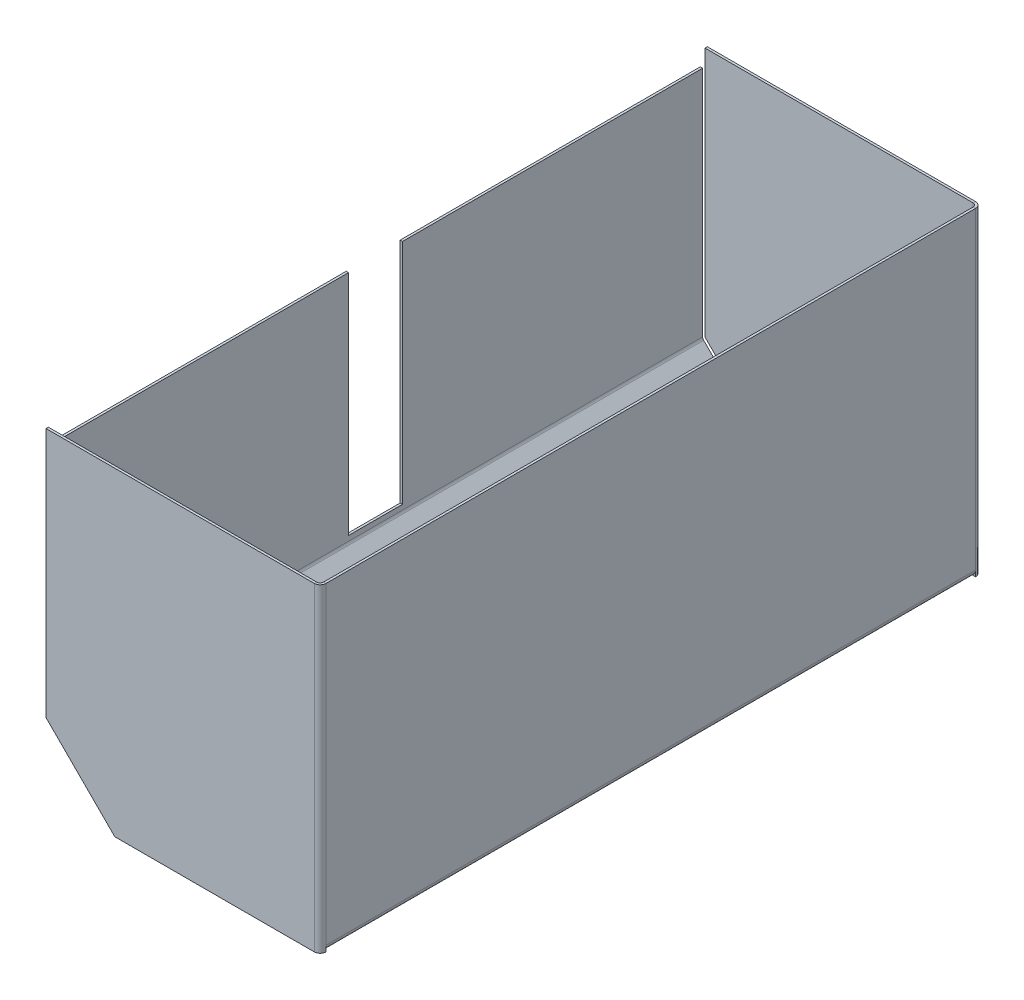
ISO-10303-21;
HEADER;
FILE_DESCRIPTION(('STEP AP214'),'2;1');
FILE_NAME('part.step','',(''),(''),'','','');
FILE_SCHEMA(('AUTOMOTIVE_DESIGN { 1 0 10303 214 1 1 1 1 }'));
ENDSEC;
DATA;
#1=APPLICATION_CONTEXT('core data for automotive mechanical design processes');
#2=APPLICATION_PROTOCOL_DEFINITION('international standard','automotive_design',2000,#1);
#3=PRODUCT_CONTEXT('',#1,'mechanical');
#4=PRODUCT('Part','Part','',(#3));
#5=PRODUCT_RELATED_PRODUCT_CATEGORY('part','',(#4));
#6=PRODUCT_DEFINITION_FORMATION('','',#4);
#7=PRODUCT_DEFINITION_CONTEXT('part definition',#1,'design');
#8=PRODUCT_DEFINITION('design','',#6,#7);
#9=PRODUCT_DEFINITION_SHAPE('','',#8);
#10=(LENGTH_UNIT() NAMED_UNIT(*) SI_UNIT(.MILLI.,.METRE.));
#11=(NAMED_UNIT(*) PLANE_ANGLE_UNIT() SI_UNIT($,.RADIAN.));
#12=(NAMED_UNIT(*) SI_UNIT($,.STERADIAN.) SOLID_ANGLE_UNIT());
#13=UNCERTAINTY_MEASURE_WITH_UNIT(LENGTH_MEASURE(1.E-05),#10,'distance_accuracy_value','');
#14=(GEOMETRIC_REPRESENTATION_CONTEXT(3) GLOBAL_UNCERTAINTY_ASSIGNED_CONTEXT((#13)) GLOBAL_UNIT_ASSIGNED_CONTEXT((#10,
#11,#12)) REPRESENTATION_CONTEXT('',''));
#15=CARTESIAN_POINT('',(0.,0.,0.));
#16=DIRECTION('',(0.,0.,1.));
#17=DIRECTION('',(1.,0.,0.));
#18=AXIS2_PLACEMENT_3D('',#15,#16,#17);
#19=CARTESIAN_POINT('',(164.59644118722,-348.502989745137,5.00000000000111));
#20=DIRECTION('',(0.,0.,-1.));
#21=DIRECTION('',(-1.,0.,0.));
#22=AXIS2_PLACEMENT_3D('',#19,#20,#21);
#23=PLANE('',#22);
#24=DIRECTION('',(-1.,0.,0.));
#25=VECTOR('',#24,1.);
#26=CARTESIAN_POINT('',(161.59644118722,-348.502989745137,5.00000000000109));
#27=LINE('',#26,#25);
#28=CARTESIAN_POINT('',(161.59644118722,-348.502989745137,5.00000000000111));
#29=VERTEX_POINT('',#28);
#30=CARTESIAN_POINT('',(159.59644118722,-348.502989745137,5.00000000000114));
#31=VERTEX_POINT('',#30);
#32=EDGE_CURVE('E1102',#29,#31,#27,.T.);
#33=ORIENTED_EDGE('',*,*,#32,.F.);
#34=CARTESIAN_POINT('',(164.59644118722,-348.502989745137,5.00000000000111));
#35=DIRECTION('',(0.,0.,1.));
#36=DIRECTION('',(1.,0.,0.));
#37=AXIS2_PLACEMENT_3D('',#34,#35,#36);
#38=CIRCLE('',#37,2.9999999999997);
#39=CARTESIAN_POINT('',(162.47512084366,-350.624310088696,5.00000000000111));
#40=VERTEX_POINT('',#39);
#41=EDGE_CURVE('E242',#40,#29,#38,.F.);
#42=ORIENTED_EDGE('',*,*,#41,.F.);
#43=DIRECTION('',(-0.707106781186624,-0.707106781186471,0.));
#44=VECTOR('',#43,1.);
#45=CARTESIAN_POINT('',(162.47512084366,-350.624310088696,5.00000000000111));
#46=LINE('',#45,#44);
#47=CARTESIAN_POINT('',(161.060907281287,-352.03852365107,5.00000000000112));
#48=VERTEX_POINT('',#47);
#49=EDGE_CURVE('E11',#40,#48,#46,.T.);
#50=ORIENTED_EDGE('',*,*,#49,.T.);
#51=CARTESIAN_POINT('',(164.59644118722,-348.502989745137,5.00000000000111));
#52=DIRECTION('',(0.,0.,1.));
#53=DIRECTION('',(1.,0.,0.));
#54=AXIS2_PLACEMENT_3D('',#51,#52,#53);
#55=CIRCLE('',#54,4.9999999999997);
#56=EDGE_CURVE('E519',#48,#31,#55,.F.);
#57=ORIENTED_EDGE('',*,*,#56,.T.);
#58=EDGE_LOOP('',(#33,#42,#50,#57));
#59=FACE_BOUND('',#58,.T.);
#60=ADVANCED_FACE('F26',(#59),#23,.T.);
#61=CARTESIAN_POINT('',(164.596441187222,-348.502989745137,559.990989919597));
#62=DIRECTION('',(0.,0.,-1.));
#63=DIRECTION('',(-1.,0.,0.));
#64=AXIS2_PLACEMENT_3D('',#61,#62,#63);
#65=PLANE('',#64);
#66=CARTESIAN_POINT('',(164.596441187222,-348.502989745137,559.990989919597));
#67=DIRECTION('',(0.,0.,1.));
#68=DIRECTION('',(1.,0.,0.));
#69=AXIS2_PLACEMENT_3D('',#66,#67,#68);
#70=CIRCLE('',#69,2.9999999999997);
#71=CARTESIAN_POINT('',(161.596441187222,-348.502989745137,559.990989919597));
#72=VERTEX_POINT('',#71);
#73=CARTESIAN_POINT('',(162.475120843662,-350.624310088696,559.990989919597));
#74=VERTEX_POINT('',#73);
#75=EDGE_CURVE('E248',#72,#74,#70,.T.);
#76=ORIENTED_EDGE('',*,*,#75,.F.);
#77=DIRECTION('',(-1.,0.,0.));
#78=VECTOR('',#77,1.);
#79=CARTESIAN_POINT('',(161.596441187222,-348.502989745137,559.990989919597));
#80=LINE('',#79,#78);
#81=CARTESIAN_POINT('',(159.596441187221,-348.502989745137,559.990989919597));
#82=VERTEX_POINT('',#81);
#83=EDGE_CURVE('E246',#72,#82,#80,.T.);
#84=ORIENTED_EDGE('',*,*,#83,.T.);
#85=CARTESIAN_POINT('',(164.596441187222,-348.502989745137,559.990989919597));
#86=DIRECTION('',(0.,0.,1.));
#87=DIRECTION('',(1.,0.,0.));
#88=AXIS2_PLACEMENT_3D('',#85,#86,#87);
#89=CIRCLE('',#88,4.9999999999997);
#90=CARTESIAN_POINT('',(161.060907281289,-352.038523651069,559.990989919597));
#91=VERTEX_POINT('',#90);
#92=EDGE_CURVE('E237',#82,#91,#89,.T.);
#93=ORIENTED_EDGE('',*,*,#92,.T.);
#94=DIRECTION('',(-0.707106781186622,-0.707106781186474,0.));
#95=VECTOR('',#94,1.);
#96=CARTESIAN_POINT('',(162.475120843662,-350.624310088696,559.990989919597));
#97=LINE('',#96,#95);
#98=EDGE_CURVE('E30',#74,#91,#97,.T.);
#99=ORIENTED_EDGE('',*,*,#98,.F.);
#100=EDGE_LOOP('',(#76,#84,#93,#99));
#101=FACE_BOUND('',#100,.T.);
#102=ADVANCED_FACE('F28',(#101),#65,.F.);
#103=CARTESIAN_POINT('',(164.596441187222,-348.502989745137,559.990989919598));
#104=DIRECTION('',(0.,0.,1.));
#105=DIRECTION('',(-1.,0.,0.));
#106=AXIS2_PLACEMENT_3D('',#103,#104,#105);
#107=CYLINDRICAL_SURFACE('',#106,4.9999999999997);
#108=DIRECTION('',(0.,0.,1.));
#109=VECTOR('',#108,1.);
#110=CARTESIAN_POINT('',(161.060907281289,-352.038523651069,559.990989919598));
#111=LINE('',#110,#109);
#112=EDGE_CURVE('E41',#91,#48,#111,.F.);
#113=ORIENTED_EDGE('',*,*,#112,.F.);
#114=ORIENTED_EDGE('',*,*,#92,.F.);
#115=DIRECTION('',(0.,0.,-1.));
#116=VECTOR('',#115,1.);
#117=CARTESIAN_POINT('',(159.59644118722,-348.502989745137,5.00000000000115));
#118=LINE('',#117,#116);
#119=EDGE_CURVE('E46',#82,#31,#118,.T.);
#120=ORIENTED_EDGE('',*,*,#119,.T.);
#121=ORIENTED_EDGE('',*,*,#56,.F.);
#122=EDGE_LOOP('',(#113,#114,#120,#121));
#123=FACE_BOUND('',#122,.T.);
#124=ADVANCED_FACE('F239',(#123),#107,.T.);
#125=CARTESIAN_POINT('',(164.596441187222,-348.502989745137,559.990989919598));
#126=DIRECTION('',(0.,0.,1.));
#127=DIRECTION('',(-1.,0.,0.));
#128=AXIS2_PLACEMENT_3D('',#125,#126,#127);
#129=CYLINDRICAL_SURFACE('',#128,2.9999999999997);
#130=DIRECTION('',(0.,0.,1.));
#131=VECTOR('',#130,1.);
#132=CARTESIAN_POINT('',(162.475120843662,-350.624310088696,559.990989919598));
#133=LINE('',#132,#131);
#134=EDGE_CURVE('E515',#74,#40,#133,.F.);
#135=ORIENTED_EDGE('',*,*,#134,.T.);
#136=ORIENTED_EDGE('',*,*,#41,.T.);
#137=DIRECTION('',(0.,0.,1.));
#138=VECTOR('',#137,1.);
#139=CARTESIAN_POINT('',(161.59644118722,-348.502989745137,5.00000000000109));
#140=LINE('',#139,#138);
#141=EDGE_CURVE('E253',#29,#72,#140,.T.);
#142=ORIENTED_EDGE('',*,*,#141,.T.);
#143=ORIENTED_EDGE('',*,*,#75,.T.);
#144=EDGE_LOOP('',(#135,#136,#142,#143));
#145=FACE_BOUND('',#144,.T.);
#146=ADVANCED_FACE('F593',(#145),#129,.F.);
#147=CARTESIAN_POINT('',(217.956044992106,-408.933661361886,559.990989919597));
#148=DIRECTION('',(0.,0.,1.));
#149=DIRECTION('',(1.,0.,0.));
#150=AXIS2_PLACEMENT_3D('',#147,#148,#149);
#151=PLANE('',#150);
#152=DIRECTION('',(0.707106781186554,-0.707106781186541,0.));
#153=VECTOR('',#152,1.);
#154=CARTESIAN_POINT('',(219.370258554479,-407.519447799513,559.990989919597));
#155=LINE('',#154,#153);
#156=CARTESIAN_POINT('',(218.49157889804,-406.640768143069,559.990989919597));
#157=VERTEX_POINT('',#156);
#158=EDGE_CURVE('E300',#74,#157,#155,.T.);
#159=ORIENTED_EDGE('',*,*,#158,.F.);
#160=ORIENTED_EDGE('',*,*,#98,.T.);
#161=DIRECTION('',(0.707106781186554,-0.707106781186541,0.));
#162=VECTOR('',#161,1.);
#163=CARTESIAN_POINT('',(217.956044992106,-408.933661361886,559.990989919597));
#164=LINE('',#163,#162);
#165=CARTESIAN_POINT('',(217.077365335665,-408.054981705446,559.990989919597));
#166=VERTEX_POINT('',#165);
#167=EDGE_CURVE('E305',#91,#166,#164,.T.);
#168=ORIENTED_EDGE('',*,*,#167,.T.);
#169=DIRECTION('',(-0.707106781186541,-0.707106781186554,0.));
#170=VECTOR('',#169,1.);
#171=CARTESIAN_POINT('',(218.491578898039,-406.640768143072,559.990989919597));
#172=LINE('',#171,#170);
#173=EDGE_CURVE('E290',#157,#166,#172,.T.);
#174=ORIENTED_EDGE('',*,*,#173,.F.);
#175=EDGE_LOOP('',(#159,#160,#168,#174));
#176=FACE_BOUND('',#175,.T.);
#177=ADVANCED_FACE('F525',(#176),#151,.T.);
#178=CARTESIAN_POINT('',(217.956044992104,-408.933661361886,5.00000000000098));
#179=DIRECTION('',(0.707106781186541,0.707106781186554,0.));
#180=DIRECTION('',(-0.707106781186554,0.707106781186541,0.));
#181=AXIS2_PLACEMENT_3D('',#178,#179,#180);
#182=PLANE('',#181);
#183=ORIENTED_EDGE('',*,*,#112,.T.);
#184=DIRECTION('',(-0.707106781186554,0.707106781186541,0.));
#185=VECTOR('',#184,1.);
#186=CARTESIAN_POINT('',(160.182227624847,-351.15984399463,5.00000000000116));
#187=LINE('',#186,#185);
#188=CARTESIAN_POINT('',(217.077365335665,-408.054981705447,5.00000000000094));
#189=VERTEX_POINT('',#188);
#190=EDGE_CURVE('E302',#189,#48,#187,.T.);
#191=ORIENTED_EDGE('',*,*,#190,.F.);
#192=DIRECTION('',(0.,0.,-1.));
#193=VECTOR('',#192,1.);
#194=CARTESIAN_POINT('',(217.077365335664,-408.054981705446,5.00000000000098));
#195=LINE('',#194,#193);
#196=EDGE_CURVE('E293',#166,#189,#195,.T.);
#197=ORIENTED_EDGE('',*,*,#196,.F.);
#198=ORIENTED_EDGE('',*,*,#167,.F.);
#199=EDGE_LOOP('',(#183,#191,#197,#198));
#200=FACE_BOUND('',#199,.T.);
#201=ADVANCED_FACE('F530',(#200),#182,.F.);
#202=CARTESIAN_POINT('',(219.370258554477,-407.519447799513,5.00000000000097));
#203=DIRECTION('',(0.707106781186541,0.707106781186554,0.));
#204=DIRECTION('',(-0.707106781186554,0.707106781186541,0.));
#205=AXIS2_PLACEMENT_3D('',#202,#203,#204);
#206=PLANE('',#205);
#207=DIRECTION('',(-0.707106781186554,0.707106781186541,0.));
#208=VECTOR('',#207,1.);
#209=CARTESIAN_POINT('',(161.59644118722,-349.745630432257,5.00000000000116));
#210=LINE('',#209,#208);
#211=CARTESIAN_POINT('',(218.491578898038,-406.640768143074,5.00000000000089));
#212=VERTEX_POINT('',#211);
#213=EDGE_CURVE('E297',#212,#40,#210,.T.);
#214=ORIENTED_EDGE('',*,*,#213,.T.);
#215=ORIENTED_EDGE('',*,*,#134,.F.);
#216=ORIENTED_EDGE('',*,*,#158,.T.);
#217=DIRECTION('',(0.,0.,1.));
#218=VECTOR('',#217,1.);
#219=CARTESIAN_POINT('',(218.491578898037,-406.640768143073,5.00000000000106));
#220=LINE('',#219,#218);
#221=EDGE_CURVE('E287',#212,#157,#220,.T.);
#222=ORIENTED_EDGE('',*,*,#221,.F.);
#223=EDGE_LOOP('',(#214,#215,#216,#222));
#224=FACE_BOUND('',#223,.T.);
#225=ADVANCED_FACE('F545',(#224),#206,.T.);
#226=CARTESIAN_POINT('',(220.612899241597,-404.519447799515,5.00000000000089));
#227=DIRECTION('',(0.,0.,-1.));
#228=DIRECTION('',(0.,1.,0.));
#229=AXIS2_PLACEMENT_3D('',#226,#227,#228);
#230=PLANE('',#229);
#231=DIRECTION('',(-0.707106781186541,-0.707106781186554,0.));
#232=VECTOR('',#231,1.);
#233=CARTESIAN_POINT('',(218.491578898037,-406.640768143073,5.00000000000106));
#234=LINE('',#233,#232);
#235=EDGE_CURVE('E279',#212,#189,#234,.T.);
#236=ORIENTED_EDGE('',*,*,#235,.F.);
#237=CARTESIAN_POINT('',(220.612899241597,-404.519447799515,5.00000000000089));
#238=DIRECTION('',(0.,0.,1.));
#239=DIRECTION('',(0.,-1.,0.));
#240=AXIS2_PLACEMENT_3D('',#237,#238,#239);
#241=CIRCLE('',#240,2.99999999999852);
#242=CARTESIAN_POINT('',(220.612899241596,-407.519447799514,5.00000000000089));
#243=VERTEX_POINT('',#242);
#244=EDGE_CURVE('E490',#243,#212,#241,.F.);
#245=ORIENTED_EDGE('',*,*,#244,.F.);
#246=DIRECTION('',(0.,-1.,0.));
#247=VECTOR('',#246,1.);
#248=CARTESIAN_POINT('',(220.612899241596,-407.519447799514,5.00000000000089));
#249=LINE('',#248,#247);
#250=CARTESIAN_POINT('',(220.612899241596,-409.519447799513,5.00000000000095));
#251=VERTEX_POINT('',#250);
#252=EDGE_CURVE('E508',#243,#251,#249,.T.);
#253=ORIENTED_EDGE('',*,*,#252,.T.);
#254=CARTESIAN_POINT('',(220.612899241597,-404.519447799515,5.00000000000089));
#255=DIRECTION('',(0.,0.,1.));
#256=DIRECTION('',(0.,-1.,0.));
#257=AXIS2_PLACEMENT_3D('',#254,#255,#256);
#258=CIRCLE('',#257,4.99999999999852);
#259=EDGE_CURVE('E502',#251,#189,#258,.F.);
#260=ORIENTED_EDGE('',*,*,#259,.T.);
#261=EDGE_LOOP('',(#236,#245,#253,#260));
#262=FACE_BOUND('',#261,.T.);
#263=ADVANCED_FACE('F535',(#262),#230,.T.);
#264=CARTESIAN_POINT('',(220.612899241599,-404.51944779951,559.990989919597));
#265=DIRECTION('',(0.,0.,-1.));
#266=DIRECTION('',(0.,1.,0.));
#267=AXIS2_PLACEMENT_3D('',#264,#265,#266);
#268=PLANE('',#267);
#269=CARTESIAN_POINT('',(220.612899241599,-404.51944779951,559.990989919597));
#270=DIRECTION('',(0.,0.,1.));
#271=DIRECTION('',(0.,-1.,0.));
#272=AXIS2_PLACEMENT_3D('',#269,#270,#271);
#273=CIRCLE('',#272,2.99999999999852);
#274=CARTESIAN_POINT('',(220.612899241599,-407.519447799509,559.990989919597));
#275=VERTEX_POINT('',#274);
#276=EDGE_CURVE('E496',#157,#275,#273,.T.);
#277=ORIENTED_EDGE('',*,*,#276,.F.);
#278=ORIENTED_EDGE('',*,*,#173,.T.);
#279=CARTESIAN_POINT('',(220.612899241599,-404.51944779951,559.990989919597));
#280=DIRECTION('',(0.,0.,1.));
#281=DIRECTION('',(0.,-1.,0.));
#282=AXIS2_PLACEMENT_3D('',#279,#280,#281);
#283=CIRCLE('',#282,4.99999999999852);
#284=CARTESIAN_POINT('',(220.612899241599,-409.519447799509,559.990989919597));
#285=VERTEX_POINT('',#284);
#286=EDGE_CURVE('E493',#166,#285,#283,.T.);
#287=ORIENTED_EDGE('',*,*,#286,.T.);
#288=DIRECTION('',(0.,-1.,0.));
#289=VECTOR('',#288,1.);
#290=CARTESIAN_POINT('',(220.612899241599,-407.519447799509,559.990989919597));
#291=LINE('',#290,#289);
#292=EDGE_CURVE('E505',#275,#285,#291,.T.);
#293=ORIENTED_EDGE('',*,*,#292,.F.);
#294=EDGE_LOOP('',(#277,#278,#287,#293));
#295=FACE_BOUND('',#294,.T.);
#296=ADVANCED_FACE('F551',(#295),#268,.F.);
#297=CARTESIAN_POINT('',(220.612899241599,-404.51944779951,559.990989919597));
#298=DIRECTION('',(0.,0.,1.));
#299=DIRECTION('',(-0.707106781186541,-0.707106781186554,0.));
#300=AXIS2_PLACEMENT_3D('',#297,#298,#299);
#301=CYLINDRICAL_SURFACE('',#300,4.99999999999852);
#302=DIRECTION('',(0.,0.,1.));
#303=VECTOR('',#302,1.);
#304=CARTESIAN_POINT('',(220.612899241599,-409.519447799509,559.990989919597));
#305=LINE('',#304,#303);
#306=EDGE_CURVE('E499',#285,#251,#305,.F.);
#307=ORIENTED_EDGE('',*,*,#306,.F.);
#308=ORIENTED_EDGE('',*,*,#286,.F.);
#309=ORIENTED_EDGE('',*,*,#196,.T.);
#310=ORIENTED_EDGE('',*,*,#259,.F.);
#311=EDGE_LOOP('',(#307,#308,#309,#310));
#312=FACE_BOUND('',#311,.T.);
#313=ADVANCED_FACE('F533',(#312),#301,.T.);
#314=CARTESIAN_POINT('',(220.612899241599,-404.51944779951,559.990989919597));
#315=DIRECTION('',(0.,0.,1.));
#316=DIRECTION('',(-0.707106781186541,-0.707106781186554,0.));
#317=AXIS2_PLACEMENT_3D('',#314,#315,#316);
#318=CYLINDRICAL_SURFACE('',#317,2.99999999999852);
#319=DIRECTION('',(0.,0.,1.));
#320=VECTOR('',#319,1.);
#321=CARTESIAN_POINT('',(220.612899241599,-407.519447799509,559.990989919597));
#322=LINE('',#321,#320);
#323=EDGE_CURVE('E494',#275,#243,#322,.F.);
#324=ORIENTED_EDGE('',*,*,#323,.T.);
#325=ORIENTED_EDGE('',*,*,#244,.T.);
#326=ORIENTED_EDGE('',*,*,#221,.T.);
#327=ORIENTED_EDGE('',*,*,#276,.T.);
#328=EDGE_LOOP('',(#324,#325,#326,#327));
#329=FACE_BOUND('',#328,.T.);
#330=ADVANCED_FACE('F548',(#329),#318,.F.);
#331=CARTESIAN_POINT('',(392.78961265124,-409.519447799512,559.990989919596));
#332=DIRECTION('',(0.,0.,1.));
#333=DIRECTION('',(1.,0.,0.));
#334=AXIS2_PLACEMENT_3D('',#331,#332,#333);
#335=PLANE('',#334);
#336=DIRECTION('',(-1.,0.,0.));
#337=VECTOR('',#336,1.);
#338=CARTESIAN_POINT('',(392.78961265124,-407.519447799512,559.990989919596));
#339=LINE('',#338,#337);
#340=CARTESIAN_POINT('',(389.789612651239,-407.519447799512,559.990989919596));
#341=VERTEX_POINT('',#340);
#342=EDGE_CURVE('E314',#275,#341,#339,.F.);
#343=ORIENTED_EDGE('',*,*,#342,.F.);
#344=ORIENTED_EDGE('',*,*,#292,.T.);
#345=DIRECTION('',(1.,0.,0.));
#346=VECTOR('',#345,1.);
#347=CARTESIAN_POINT('',(392.78961265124,-409.519447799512,559.990989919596));
#348=LINE('',#347,#346);
#349=CARTESIAN_POINT('',(389.78961265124,-409.519447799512,559.990989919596));
#350=VERTEX_POINT('',#349);
#351=EDGE_CURVE('E308',#285,#350,#348,.T.);
#352=ORIENTED_EDGE('',*,*,#351,.T.);
#353=DIRECTION('',(0.,-1.,0.));
#354=VECTOR('',#353,1.);
#355=CARTESIAN_POINT('',(389.78961265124,-407.519447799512,559.990989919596));
#356=LINE('',#355,#354);
#357=EDGE_CURVE('E322',#341,#350,#356,.T.);
#358=ORIENTED_EDGE('',*,*,#357,.F.);
#359=EDGE_LOOP('',(#343,#344,#352,#358));
#360=FACE_BOUND('',#359,.T.);
#361=ADVANCED_FACE('F555',(#360),#335,.T.);
#362=CARTESIAN_POINT('',(392.78961265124,-409.519447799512,559.990989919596));
#363=DIRECTION('',(0.,-1.,0.));
#364=DIRECTION('',(1.,0.,0.));
#365=AXIS2_PLACEMENT_3D('',#362,#363,#364);
#366=PLANE('',#365);
#367=ORIENTED_EDGE('',*,*,#351,.F.);
#368=ORIENTED_EDGE('',*,*,#306,.T.);
#369=DIRECTION('',(-1.,0.,0.));
#370=VECTOR('',#369,1.);
#371=CARTESIAN_POINT('',(219.370258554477,-409.519447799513,5.00000000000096));
#372=LINE('',#371,#370);
#373=CARTESIAN_POINT('',(389.789612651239,-409.519447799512,5.));
#374=VERTEX_POINT('',#373);
#375=EDGE_CURVE('E311',#374,#251,#372,.T.);
#376=ORIENTED_EDGE('',*,*,#375,.F.);
#377=DIRECTION('',(0.,0.,1.));
#378=VECTOR('',#377,1.);
#379=CARTESIAN_POINT('',(389.78961265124,-409.519447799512,559.990989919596));
#380=LINE('',#379,#378);
#381=EDGE_CURVE('E319',#374,#350,#380,.T.);
#382=ORIENTED_EDGE('',*,*,#381,.T.);
#383=EDGE_LOOP('',(#367,#368,#376,#382));
#384=FACE_BOUND('',#383,.T.);
#385=ADVANCED_FACE('F559',(#384),#366,.T.);
#386=CARTESIAN_POINT('',(392.78961265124,-407.519447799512,559.990989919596));
#387=DIRECTION('',(0.,-1.,0.));
#388=DIRECTION('',(1.,0.,0.));
#389=AXIS2_PLACEMENT_3D('',#386,#387,#388);
#390=PLANE('',#389);
#391=ORIENTED_EDGE('',*,*,#323,.F.);
#392=ORIENTED_EDGE('',*,*,#342,.T.);
#393=DIRECTION('',(0.,0.,-1.));
#394=VECTOR('',#393,1.);
#395=CARTESIAN_POINT('',(389.789612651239,-407.519447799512,5.00000000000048));
#396=LINE('',#395,#394);
#397=CARTESIAN_POINT('',(389.789612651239,-407.519447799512,5.));
#398=VERTEX_POINT('',#397);
#399=EDGE_CURVE('E325',#398,#341,#396,.F.);
#400=ORIENTED_EDGE('',*,*,#399,.F.);
#401=DIRECTION('',(1.,0.,0.));
#402=VECTOR('',#401,1.);
#403=CARTESIAN_POINT('',(392.789612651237,-407.519447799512,5.));
#404=LINE('',#403,#402);
#405=EDGE_CURVE('E316',#398,#243,#404,.F.);
#406=ORIENTED_EDGE('',*,*,#405,.T.);
#407=EDGE_LOOP('',(#391,#392,#400,#406));
#408=FACE_BOUND('',#407,.T.);
#409=ADVANCED_FACE('F577',(#408),#390,.F.);
#410=CARTESIAN_POINT('',(389.789612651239,-404.519447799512,559.990989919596));
#411=DIRECTION('',(0.,0.,-1.));
#412=DIRECTION('',(-1.,0.,0.));
#413=AXIS2_PLACEMENT_3D('',#410,#411,#412);
#414=PLANE('',#413);
#415=CARTESIAN_POINT('',(389.789612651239,-404.519447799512,559.990989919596));
#416=DIRECTION('',(0.,0.,1.));
#417=DIRECTION('',(1.,0.,0.));
#418=AXIS2_PLACEMENT_3D('',#415,#416,#417);
#419=CIRCLE('',#418,5.00000000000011);
#420=CARTESIAN_POINT('',(392.78961265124,-408.519447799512,559.990989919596));
#421=VERTEX_POINT('',#420);
#422=EDGE_CURVE('E484',#350,#421,#419,.T.);
#423=ORIENTED_EDGE('',*,*,#422,.T.);
#424=DIRECTION('',(-1.66533453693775E-13,1.,0.));
#425=VECTOR('',#424,1.);
#426=CARTESIAN_POINT('',(392.78961265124,-409.519447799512,559.990989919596));
#427=LINE('',#426,#425);
#428=CARTESIAN_POINT('',(392.78961265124,-404.519447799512,559.990989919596));
#429=VERTEX_POINT('',#428);
#430=EDGE_CURVE('E333',#421,#429,#427,.T.);
#431=ORIENTED_EDGE('',*,*,#430,.T.);
#432=CARTESIAN_POINT('',(389.789612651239,-404.519447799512,559.990989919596));
#433=DIRECTION('',(0.,0.,1.));
#434=DIRECTION('',(1.,0.,0.));
#435=AXIS2_PLACEMENT_3D('',#432,#433,#434);
#436=CIRCLE('',#435,3.00000000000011);
#437=EDGE_CURVE('E468',#341,#429,#436,.T.);
#438=ORIENTED_EDGE('',*,*,#437,.F.);
#439=ORIENTED_EDGE('',*,*,#357,.T.);
#440=EDGE_LOOP('',(#423,#431,#438,#439));
#441=FACE_BOUND('',#440,.T.);
#442=ADVANCED_FACE('F579',(#441),#414,.F.);
#443=CARTESIAN_POINT('',(389.789612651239,-404.519447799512,5.));
#444=DIRECTION('',(0.,0.,-1.));
#445=DIRECTION('',(-1.,0.,0.));
#446=AXIS2_PLACEMENT_3D('',#443,#444,#445);
#447=PLANE('',#446);
#448=DIRECTION('',(0.,1.,0.));
#449=VECTOR('',#448,1.);
#450=CARTESIAN_POINT('',(392.789612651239,-409.519447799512,5.));
#451=LINE('',#450,#449);
#452=CARTESIAN_POINT('',(392.789612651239,-408.519447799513,5.));
#453=VERTEX_POINT('',#452);
#454=CARTESIAN_POINT('',(392.789612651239,-404.519447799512,5.));
#455=VERTEX_POINT('',#454);
#456=EDGE_CURVE('E395',#453,#455,#451,.T.);
#457=ORIENTED_EDGE('',*,*,#456,.F.);
#458=CARTESIAN_POINT('',(389.789612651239,-404.519447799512,5.));
#459=DIRECTION('',(0.,0.,1.));
#460=DIRECTION('',(1.,0.,0.));
#461=AXIS2_PLACEMENT_3D('',#458,#459,#460);
#462=CIRCLE('',#461,5.00000000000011);
#463=EDGE_CURVE('E483',#453,#374,#462,.F.);
#464=ORIENTED_EDGE('',*,*,#463,.T.);
#465=DIRECTION('',(0.,-1.,0.));
#466=VECTOR('',#465,1.);
#467=CARTESIAN_POINT('',(389.789612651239,-409.519447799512,5.00000000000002));
#468=LINE('',#467,#466);
#469=EDGE_CURVE('E307',#398,#374,#468,.T.);
#470=ORIENTED_EDGE('',*,*,#469,.F.);
#471=CARTESIAN_POINT('',(389.789612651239,-404.519447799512,5.));
#472=DIRECTION('',(0.,0.,1.));
#473=DIRECTION('',(1.,0.,0.));
#474=AXIS2_PLACEMENT_3D('',#471,#472,#473);
#475=CIRCLE('',#474,3.00000000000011);
#476=EDGE_CURVE('E471',#455,#398,#475,.F.);
#477=ORIENTED_EDGE('',*,*,#476,.F.);
#478=EDGE_LOOP('',(#457,#464,#470,#477));
#479=FACE_BOUND('',#478,.T.);
#480=ADVANCED_FACE('F569',(#479),#447,.T.);
#481=CARTESIAN_POINT('',(389.789612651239,-404.519447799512,559.990989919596));
#482=DIRECTION('',(0.,0.,1.));
#483=DIRECTION('',(0.,-1.,0.));
#484=AXIS2_PLACEMENT_3D('',#481,#482,#483);
#485=CYLINDRICAL_SURFACE('',#484,5.00000000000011);
#486=DIRECTION('',(0.,0.,1.));
#487=VECTOR('',#486,1.);
#488=CARTESIAN_POINT('',(394.78961265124,-404.519447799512,559.990989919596));
#489=LINE('',#488,#487);
#490=CARTESIAN_POINT('',(394.78961265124,-404.519447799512,559.990989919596));
#491=VERTEX_POINT('',#490);
#492=CARTESIAN_POINT('',(394.78961265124,-404.519447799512,5.));
#493=VERTEX_POINT('',#492);
#494=EDGE_CURVE('E480',#491,#493,#489,.F.);
#495=ORIENTED_EDGE('',*,*,#494,.F.);
#496=EDGE_CURVE('E474',#421,#491,#419,.T.);
#497=ORIENTED_EDGE('',*,*,#496,.F.);
#498=ORIENTED_EDGE('',*,*,#422,.F.);
#499=ORIENTED_EDGE('',*,*,#381,.F.);
#500=ORIENTED_EDGE('',*,*,#463,.F.);
#501=EDGE_CURVE('E485',#493,#453,#462,.F.);
#502=ORIENTED_EDGE('',*,*,#501,.F.);
#503=EDGE_LOOP('',(#495,#497,#498,#499,#500,#502));
#504=FACE_BOUND('',#503,.T.);
#505=ADVANCED_FACE('F564',(#504),#485,.T.);
#506=CARTESIAN_POINT('',(389.789612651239,-404.519447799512,559.990989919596));
#507=DIRECTION('',(0.,0.,1.));
#508=DIRECTION('',(0.,-1.,0.));
#509=AXIS2_PLACEMENT_3D('',#506,#507,#508);
#510=CYLINDRICAL_SURFACE('',#509,3.00000000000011);
#511=DIRECTION('',(0.,0.,1.));
#512=VECTOR('',#511,1.);
#513=CARTESIAN_POINT('',(392.78961265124,-404.519447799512,559.990989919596));
#514=LINE('',#513,#512);
#515=EDGE_CURVE('E475',#429,#455,#514,.F.);
#516=ORIENTED_EDGE('',*,*,#515,.T.);
#517=ORIENTED_EDGE('',*,*,#476,.T.);
#518=ORIENTED_EDGE('',*,*,#399,.T.);
#519=ORIENTED_EDGE('',*,*,#437,.T.);
#520=EDGE_LOOP('',(#516,#517,#518,#519));
#521=FACE_BOUND('',#520,.T.);
#522=ADVANCED_FACE('F572',(#521),#510,.F.);
#523=CARTESIAN_POINT('',(394.78961265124,-409.519447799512,564.990989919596));
#524=DIRECTION('',(-1.,0.,0.));
#525=DIRECTION('',(0.,0.,1.));
#526=AXIS2_PLACEMENT_3D('',#523,#524,#525);
#527=PLANE('',#526);
#528=ORIENTED_EDGE('',*,*,#494,.T.);
#529=DIRECTION('',(0.,1.,0.));
#530=VECTOR('',#529,1.);
#531=CARTESIAN_POINT('',(394.789612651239,-409.519447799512,5.));
#532=LINE('',#531,#530);
#533=CARTESIAN_POINT('',(394.789612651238,-136.858787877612,5.));
#534=VERTEX_POINT('',#533);
#535=EDGE_CURVE('E385',#534,#493,#532,.F.);
#536=ORIENTED_EDGE('',*,*,#535,.F.);
#537=DIRECTION('',(0.,0.,1.));
#538=VECTOR('',#537,1.);
#539=CARTESIAN_POINT('',(394.78961265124,-136.858787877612,564.990989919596));
#540=LINE('',#539,#538);
#541=CARTESIAN_POINT('',(394.78961265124,-136.858787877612,559.990989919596));
#542=VERTEX_POINT('',#541);
#543=EDGE_CURVE('E378',#534,#542,#540,.T.);
#544=ORIENTED_EDGE('',*,*,#543,.T.);
#545=DIRECTION('',(0.,1.,0.));
#546=VECTOR('',#545,1.);
#547=CARTESIAN_POINT('',(394.78961265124,-136.858787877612,559.990989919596));
#548=LINE('',#547,#546);
#549=EDGE_CURVE('E456',#542,#491,#548,.F.);
#550=ORIENTED_EDGE('',*,*,#549,.T.);
#551=EDGE_LOOP('',(#528,#536,#544,#550));
#552=FACE_BOUND('',#551,.T.);
#553=ADVANCED_FACE('F616',(#552),#527,.F.);
#554=CARTESIAN_POINT('',(392.78961265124,-409.519447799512,564.990989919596));
#555=DIRECTION('',(-1.,0.,0.));
#556=DIRECTION('',(0.,0.,1.));
#557=AXIS2_PLACEMENT_3D('',#554,#555,#556);
#558=PLANE('',#557);
#559=CARTESIAN_POINT('',(392.789612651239,-136.858787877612,5.));
#560=VERTEX_POINT('',#559);
#561=EDGE_CURVE('E394',#455,#560,#451,.T.);
#562=ORIENTED_EDGE('',*,*,#561,.F.);
#563=ORIENTED_EDGE('',*,*,#515,.F.);
#564=DIRECTION('',(0.,1.,0.));
#565=VECTOR('',#564,1.);
#566=CARTESIAN_POINT('',(392.78961265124,-136.858787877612,559.990989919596));
#567=LINE('',#566,#565);
#568=CARTESIAN_POINT('',(392.78961265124,-136.858787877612,559.990989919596));
#569=VERTEX_POINT('',#568);
#570=EDGE_CURVE('E451',#569,#429,#567,.F.);
#571=ORIENTED_EDGE('',*,*,#570,.F.);
#572=DIRECTION('',(0.,0.,-1.));
#573=VECTOR('',#572,1.);
#574=CARTESIAN_POINT('',(392.78961265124,-136.858787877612,564.990989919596));
#575=LINE('',#574,#573);
#576=EDGE_CURVE('E382',#560,#569,#575,.F.);
#577=ORIENTED_EDGE('',*,*,#576,.F.);
#578=EDGE_LOOP('',(#562,#563,#571,#577));
#579=FACE_BOUND('',#578,.T.);
#580=ADVANCED_FACE('F626',(#579),#558,.T.);
#581=CARTESIAN_POINT('',(389.78961265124,-409.519447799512,559.990989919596));
#582=DIRECTION('',(0.,-1.,0.));
#583=DIRECTION('',(0.,0.,-1.));
#584=AXIS2_PLACEMENT_3D('',#581,#582,#583);
#585=PLANE('',#584);
#586=DIRECTION('',(0.,0.,1.));
#587=VECTOR('',#586,1.);
#588=CARTESIAN_POINT('',(389.78961265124,-409.519447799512,564.990989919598));
#589=LINE('',#588,#587);
#590=CARTESIAN_POINT('',(389.78961265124,-409.519447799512,562.990989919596));
#591=VERTEX_POINT('',#590);
#592=CARTESIAN_POINT('',(389.78961265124,-409.519447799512,564.990989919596));
#593=VERTEX_POINT('',#592);
#594=EDGE_CURVE('E338',#591,#593,#589,.T.);
#595=ORIENTED_EDGE('',*,*,#594,.F.);
#596=CARTESIAN_POINT('',(389.78961265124,-409.519447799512,559.990989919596));
#597=DIRECTION('',(0.,1.,0.));
#598=DIRECTION('',(0.,0.,1.));
#599=AXIS2_PLACEMENT_3D('',#596,#597,#598);
#600=CIRCLE('',#599,3.);
#601=CARTESIAN_POINT('',(392.78961265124,-409.519447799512,559.990989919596));
#602=VERTEX_POINT('',#601);
#603=EDGE_CURVE('E447',#602,#591,#600,.F.);
#604=ORIENTED_EDGE('',*,*,#603,.F.);
#605=DIRECTION('',(1.,0.,0.));
#606=VECTOR('',#605,1.);
#607=CARTESIAN_POINT('',(392.78961265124,-409.519447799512,559.990989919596));
#608=LINE('',#607,#606);
#609=CARTESIAN_POINT('',(394.78961265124,-409.519447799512,559.990989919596));
#610=VERTEX_POINT('',#609);
#611=EDGE_CURVE('E465',#602,#610,#608,.T.);
#612=ORIENTED_EDGE('',*,*,#611,.T.);
#613=CARTESIAN_POINT('',(389.78961265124,-409.519447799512,559.990989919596));
#614=DIRECTION('',(0.,1.,0.));
#615=DIRECTION('',(0.,0.,1.));
#616=AXIS2_PLACEMENT_3D('',#613,#614,#615);
#617=CIRCLE('',#616,5.);
#618=EDGE_CURVE('E459',#610,#593,#617,.F.);
#619=ORIENTED_EDGE('',*,*,#618,.T.);
#620=EDGE_LOOP('',(#595,#604,#612,#619));
#621=FACE_BOUND('',#620,.T.);
#622=ADVANCED_FACE('F621',(#621),#585,.T.);
#623=CARTESIAN_POINT('',(389.78961265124,-136.858787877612,559.990989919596));
#624=DIRECTION('',(0.,-1.,0.));
#625=DIRECTION('',(0.,0.,-1.));
#626=AXIS2_PLACEMENT_3D('',#623,#624,#625);
#627=PLANE('',#626);
#628=CARTESIAN_POINT('',(389.78961265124,-136.858787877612,559.990989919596));
#629=DIRECTION('',(0.,1.,0.));
#630=DIRECTION('',(0.,0.,1.));
#631=AXIS2_PLACEMENT_3D('',#628,#629,#630);
#632=CIRCLE('',#631,3.);
#633=CARTESIAN_POINT('',(389.78961265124,-136.858787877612,562.990989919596));
#634=VERTEX_POINT('',#633);
#635=EDGE_CURVE('E444',#634,#569,#632,.T.);
#636=ORIENTED_EDGE('',*,*,#635,.F.);
#637=DIRECTION('',(0.,0.,1.));
#638=VECTOR('',#637,1.);
#639=CARTESIAN_POINT('',(389.78961265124,-136.858787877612,562.990989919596));
#640=LINE('',#639,#638);
#641=CARTESIAN_POINT('',(389.78961265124,-136.858787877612,564.990989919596));
#642=VERTEX_POINT('',#641);
#643=EDGE_CURVE('E371',#634,#642,#640,.T.);
#644=ORIENTED_EDGE('',*,*,#643,.T.);
#645=CARTESIAN_POINT('',(389.78961265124,-136.858787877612,559.990989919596));
#646=DIRECTION('',(0.,1.,0.));
#647=DIRECTION('',(0.,0.,1.));
#648=AXIS2_PLACEMENT_3D('',#645,#646,#647);
#649=CIRCLE('',#648,5.);
#650=EDGE_CURVE('E450',#642,#542,#649,.T.);
#651=ORIENTED_EDGE('',*,*,#650,.T.);
#652=DIRECTION('',(1.,0.,0.));
#653=VECTOR('',#652,1.);
#654=CARTESIAN_POINT('',(392.78961265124,-136.858787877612,559.990989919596));
#655=LINE('',#654,#653);
#656=EDGE_CURVE('E462',#569,#542,#655,.T.);
#657=ORIENTED_EDGE('',*,*,#656,.F.);
#658=EDGE_LOOP('',(#636,#644,#651,#657));
#659=FACE_BOUND('',#658,.T.);
#660=ADVANCED_FACE('F617',(#659),#627,.F.);
#661=CARTESIAN_POINT('',(389.78961265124,-136.858787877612,559.990989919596));
#662=DIRECTION('',(0.,1.,0.));
#663=DIRECTION('',(0.,0.,1.));
#664=AXIS2_PLACEMENT_3D('',#661,#662,#663);
#665=CYLINDRICAL_SURFACE('',#664,5.);
#666=ORIENTED_EDGE('',*,*,#549,.F.);
#667=ORIENTED_EDGE('',*,*,#650,.F.);
#668=DIRECTION('',(0.,1.,0.));
#669=VECTOR('',#668,1.);
#670=CARTESIAN_POINT('',(389.78961265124,-409.519447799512,564.990989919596));
#671=LINE('',#670,#669);
#672=EDGE_CURVE('E369',#642,#593,#671,.F.);
#673=ORIENTED_EDGE('',*,*,#672,.T.);
#674=ORIENTED_EDGE('',*,*,#618,.F.);
#675=DIRECTION('',(0.,-1.,0.));
#676=VECTOR('',#675,1.);
#677=CARTESIAN_POINT('',(394.78961265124,-409.519447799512,559.990989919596));
#678=LINE('',#677,#676);
#679=EDGE_CURVE('E336',#491,#610,#678,.T.);
#680=ORIENTED_EDGE('',*,*,#679,.F.);
#681=EDGE_LOOP('',(#666,#667,#673,#674,#680));
#682=FACE_BOUND('',#681,.T.);
#683=ADVANCED_FACE('F620',(#682),#665,.T.);
#684=CARTESIAN_POINT('',(389.78961265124,-136.858787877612,559.990989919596));
#685=DIRECTION('',(0.,1.,0.));
#686=DIRECTION('',(0.,0.,1.));
#687=AXIS2_PLACEMENT_3D('',#684,#685,#686);
#688=CYLINDRICAL_SURFACE('',#687,3.);
#689=ORIENTED_EDGE('',*,*,#570,.T.);
#690=ORIENTED_EDGE('',*,*,#430,.F.);
#691=EDGE_CURVE('E310',#602,#421,#427,.T.);
#692=ORIENTED_EDGE('',*,*,#691,.F.);
#693=ORIENTED_EDGE('',*,*,#603,.T.);
#694=DIRECTION('',(0.,1.,0.));
#695=VECTOR('',#694,1.);
#696=CARTESIAN_POINT('',(389.78961265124,-409.519447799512,562.990989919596));
#697=LINE('',#696,#695);
#698=EDGE_CURVE('E374',#591,#634,#697,.T.);
#699=ORIENTED_EDGE('',*,*,#698,.T.);
#700=ORIENTED_EDGE('',*,*,#635,.T.);
#701=EDGE_LOOP('',(#689,#690,#692,#693,#699,#700));
#702=FACE_BOUND('',#701,.T.);
#703=ADVANCED_FACE('F623',(#702),#688,.F.);
#704=CARTESIAN_POINT('',(394.78961265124,-136.858787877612,564.990989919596));
#705=DIRECTION('',(0.,-1.,0.));
#706=DIRECTION('',(1.,0.,0.));
#707=AXIS2_PLACEMENT_3D('',#704,#705,#706);
#708=PLANE('',#707);
#709=ORIENTED_EDGE('',*,*,#656,.T.);
#710=ORIENTED_EDGE('',*,*,#543,.F.);
#711=DIRECTION('',(-1.,0.,0.));
#712=VECTOR('',#711,1.);
#713=CARTESIAN_POINT('',(392.789612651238,-136.858787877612,5.));
#714=LINE('',#713,#712);
#715=EDGE_CURVE('E388',#560,#534,#714,.F.);
#716=ORIENTED_EDGE('',*,*,#715,.F.);
#717=ORIENTED_EDGE('',*,*,#576,.T.);
#718=EDGE_LOOP('',(#709,#710,#716,#717));
#719=FACE_BOUND('',#718,.T.);
#720=ADVANCED_FACE('F633',(#719),#708,.F.);
#721=CARTESIAN_POINT('',(389.789612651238,-409.519447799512,5.00000000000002));
#722=DIRECTION('',(0.,-1.,0.));
#723=DIRECTION('',(0.,0.,-1.));
#724=AXIS2_PLACEMENT_3D('',#721,#722,#723);
#725=PLANE('',#724);
#726=DIRECTION('',(-1.,0.,0.));
#727=VECTOR('',#726,1.);
#728=CARTESIAN_POINT('',(394.789612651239,-409.519447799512,5.));
#729=LINE('',#728,#727);
#730=CARTESIAN_POINT('',(392.789612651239,-409.519447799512,5.));
#731=VERTEX_POINT('',#730);
#732=CARTESIAN_POINT('',(394.789612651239,-409.519447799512,5.));
#733=VERTEX_POINT('',#732);
#734=EDGE_CURVE('E341',#731,#733,#729,.F.);
#735=ORIENTED_EDGE('',*,*,#734,.F.);
#736=CARTESIAN_POINT('',(389.789612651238,-409.519447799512,5.00000000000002));
#737=DIRECTION('',(0.,1.,0.));
#738=DIRECTION('',(0.,0.,1.));
#739=AXIS2_PLACEMENT_3D('',#736,#737,#738);
#740=CIRCLE('',#739,3.00000000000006);
#741=CARTESIAN_POINT('',(389.789612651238,-409.519447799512,1.99999999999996));
#742=VERTEX_POINT('',#741);
#743=EDGE_CURVE('E424',#742,#731,#740,.F.);
#744=ORIENTED_EDGE('',*,*,#743,.F.);
#745=DIRECTION('',(0.,0.,-1.));
#746=VECTOR('',#745,1.);
#747=CARTESIAN_POINT('',(389.789612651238,-409.519447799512,1.99999999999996));
#748=LINE('',#747,#746);
#749=CARTESIAN_POINT('',(389.789612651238,-409.519447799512,0.));
#750=VERTEX_POINT('',#749);
#751=EDGE_CURVE('E441',#742,#750,#748,.T.);
#752=ORIENTED_EDGE('',*,*,#751,.T.);
#753=CARTESIAN_POINT('',(389.789612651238,-409.519447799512,5.00000000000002));
#754=DIRECTION('',(0.,1.,0.));
#755=DIRECTION('',(0.,0.,1.));
#756=AXIS2_PLACEMENT_3D('',#753,#754,#755);
#757=CIRCLE('',#756,5.00000000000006);
#758=EDGE_CURVE('E435',#750,#733,#757,.F.);
#759=ORIENTED_EDGE('',*,*,#758,.T.);
#760=EDGE_LOOP('',(#735,#744,#752,#759));
#761=FACE_BOUND('',#760,.T.);
#762=ADVANCED_FACE('F639',(#761),#725,.T.);
#763=CARTESIAN_POINT('',(389.789612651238,-136.858787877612,5.00000000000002));
#764=DIRECTION('',(0.,-1.,0.));
#765=DIRECTION('',(0.,0.,-1.));
#766=AXIS2_PLACEMENT_3D('',#763,#764,#765);
#767=PLANE('',#766);
#768=CARTESIAN_POINT('',(389.789612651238,-136.858787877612,5.00000000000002));
#769=DIRECTION('',(0.,1.,0.));
#770=DIRECTION('',(0.,0.,1.));
#771=AXIS2_PLACEMENT_3D('',#768,#769,#770);
#772=CIRCLE('',#771,3.00000000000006);
#773=CARTESIAN_POINT('',(389.789612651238,-136.858787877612,1.99999999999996));
#774=VERTEX_POINT('',#773);
#775=EDGE_CURVE('E423',#560,#774,#772,.T.);
#776=ORIENTED_EDGE('',*,*,#775,.F.);
#777=ORIENTED_EDGE('',*,*,#715,.T.);
#778=CARTESIAN_POINT('',(389.789612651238,-136.858787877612,5.00000000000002));
#779=DIRECTION('',(0.,1.,0.));
#780=DIRECTION('',(0.,0.,1.));
#781=AXIS2_PLACEMENT_3D('',#778,#779,#780);
#782=CIRCLE('',#781,5.00000000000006);
#783=CARTESIAN_POINT('',(389.789612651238,-136.858787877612,0.));
#784=VERTEX_POINT('',#783);
#785=EDGE_CURVE('E427',#534,#784,#782,.T.);
#786=ORIENTED_EDGE('',*,*,#785,.T.);
#787=DIRECTION('',(0.,0.,-1.));
#788=VECTOR('',#787,1.);
#789=CARTESIAN_POINT('',(389.789612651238,-136.858787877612,1.99999999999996));
#790=LINE('',#789,#788);
#791=EDGE_CURVE('E438',#774,#784,#790,.T.);
#792=ORIENTED_EDGE('',*,*,#791,.F.);
#793=EDGE_LOOP('',(#776,#777,#786,#792));
#794=FACE_BOUND('',#793,.T.);
#795=ADVANCED_FACE('F635',(#794),#767,.F.);
#796=CARTESIAN_POINT('',(389.789612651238,-136.858787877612,5.00000000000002));
#797=DIRECTION('',(0.,1.,0.));
#798=DIRECTION('',(1.,0.,0.));
#799=AXIS2_PLACEMENT_3D('',#796,#797,#798);
#800=CYLINDRICAL_SURFACE('',#799,5.00000000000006);
#801=DIRECTION('',(0.,1.,0.));
#802=VECTOR('',#801,1.);
#803=CARTESIAN_POINT('',(389.789612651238,-136.858787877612,0.));
#804=LINE('',#803,#802);
#805=EDGE_CURVE('E432',#784,#750,#804,.F.);
#806=ORIENTED_EDGE('',*,*,#805,.F.);
#807=ORIENTED_EDGE('',*,*,#785,.F.);
#808=ORIENTED_EDGE('',*,*,#535,.T.);
#809=DIRECTION('',(0.,1.,0.));
#810=VECTOR('',#809,1.);
#811=CARTESIAN_POINT('',(394.789612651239,-136.858787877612,5.));
#812=LINE('',#811,#810);
#813=EDGE_CURVE('E332',#493,#733,#812,.F.);
#814=ORIENTED_EDGE('',*,*,#813,.T.);
#815=ORIENTED_EDGE('',*,*,#758,.F.);
#816=EDGE_LOOP('',(#806,#807,#808,#814,#815));
#817=FACE_BOUND('',#816,.T.);
#818=ADVANCED_FACE('F638',(#817),#800,.T.);
#819=CARTESIAN_POINT('',(389.789612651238,-136.858787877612,5.00000000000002));
#820=DIRECTION('',(0.,1.,0.));
#821=DIRECTION('',(1.,0.,0.));
#822=AXIS2_PLACEMENT_3D('',#819,#820,#821);
#823=CYLINDRICAL_SURFACE('',#822,3.00000000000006);
#824=DIRECTION('',(0.,1.,0.));
#825=VECTOR('',#824,1.);
#826=CARTESIAN_POINT('',(389.789612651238,-136.858787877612,1.99999999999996));
#827=LINE('',#826,#825);
#828=EDGE_CURVE('E428',#774,#742,#827,.F.);
#829=ORIENTED_EDGE('',*,*,#828,.T.);
#830=ORIENTED_EDGE('',*,*,#743,.T.);
#831=EDGE_CURVE('E391',#731,#453,#451,.T.);
#832=ORIENTED_EDGE('',*,*,#831,.T.);
#833=ORIENTED_EDGE('',*,*,#456,.T.);
#834=ORIENTED_EDGE('',*,*,#561,.T.);
#835=ORIENTED_EDGE('',*,*,#775,.T.);
#836=EDGE_LOOP('',(#829,#830,#832,#833,#834,#835));
#837=FACE_BOUND('',#836,.T.);
#838=ADVANCED_FACE('F641',(#837),#823,.F.);
#839=CARTESIAN_POINT('',(160.596441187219,-136.858787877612,2.));
#840=DIRECTION('',(0.,-1.,0.));
#841=DIRECTION('',(0.,0.,-1.));
#842=AXIS2_PLACEMENT_3D('',#839,#840,#841);
#843=PLANE('',#842);
#844=ORIENTED_EDGE('',*,*,#791,.T.);
#845=DIRECTION('',(-1.,0.,0.));
#846=VECTOR('',#845,1.);
#847=CARTESIAN_POINT('',(160.596441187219,-136.858787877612,0.));
#848=LINE('',#847,#846);
#849=CARTESIAN_POINT('',(160.596441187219,-136.858787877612,0.));
#850=VERTEX_POINT('',#849);
#851=EDGE_CURVE('E381',#784,#850,#848,.T.);
#852=ORIENTED_EDGE('',*,*,#851,.T.);
#853=DIRECTION('',(0.,0.,-1.));
#854=VECTOR('',#853,1.);
#855=CARTESIAN_POINT('',(160.596441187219,-136.858787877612,2.));
#856=LINE('',#855,#854);
#857=CARTESIAN_POINT('',(160.596441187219,-136.858787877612,2.));
#858=VERTEX_POINT('',#857);
#859=EDGE_CURVE('E420',#858,#850,#856,.T.);
#860=ORIENTED_EDGE('',*,*,#859,.F.);
#861=DIRECTION('',(-1.,0.,0.));
#862=VECTOR('',#861,1.);
#863=CARTESIAN_POINT('',(160.596441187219,-136.858787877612,2.));
#864=LINE('',#863,#862);
#865=EDGE_CURVE('E405',#774,#858,#864,.T.);
#866=ORIENTED_EDGE('',*,*,#865,.F.);
#867=EDGE_LOOP('',(#844,#852,#860,#866));
#868=FACE_BOUND('',#867,.T.);
#869=ADVANCED_FACE('F650',(#868),#843,.F.);
#870=CARTESIAN_POINT('',(394.789612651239,-409.519447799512,2.));
#871=DIRECTION('',(0.,1.,0.));
#872=DIRECTION('',(0.,0.,1.));
#873=AXIS2_PLACEMENT_3D('',#870,#871,#872);
#874=PLANE('',#873);
#875=ORIENTED_EDGE('',*,*,#751,.F.);
#876=DIRECTION('',(1.,0.,0.));
#877=VECTOR('',#876,1.);
#878=CARTESIAN_POINT('',(394.789612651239,-409.519447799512,2.));
#879=LINE('',#878,#877);
#880=CARTESIAN_POINT('',(219.370258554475,-409.519447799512,2.));
#881=VERTEX_POINT('',#880);
#882=EDGE_CURVE('E411',#881,#742,#879,.T.);
#883=ORIENTED_EDGE('',*,*,#882,.F.);
#884=DIRECTION('',(0.,0.,-1.));
#885=VECTOR('',#884,1.);
#886=CARTESIAN_POINT('',(219.370258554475,-409.519447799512,2.));
#887=LINE('',#886,#885);
#888=CARTESIAN_POINT('',(219.370258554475,-409.519447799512,0.));
#889=VERTEX_POINT('',#888);
#890=EDGE_CURVE('E414',#881,#889,#887,.T.);
#891=ORIENTED_EDGE('',*,*,#890,.T.);
#892=DIRECTION('',(1.,0.,0.));
#893=VECTOR('',#892,1.);
#894=CARTESIAN_POINT('',(394.789612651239,-409.519447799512,0.));
#895=LINE('',#894,#893);
#896=EDGE_CURVE('E402',#889,#750,#895,.T.);
#897=ORIENTED_EDGE('',*,*,#896,.T.);
#898=EDGE_LOOP('',(#875,#883,#891,#897));
#899=FACE_BOUND('',#898,.T.);
#900=ADVANCED_FACE('F654',(#899),#874,.F.);
#901=CARTESIAN_POINT('',(160.596441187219,-136.858787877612,2.));
#902=DIRECTION('',(0.,0.,1.));
#903=DIRECTION('',(1.,0.,0.));
#904=AXIS2_PLACEMENT_3D('',#901,#902,#903);
#905=PLANE('',#904);
#906=ORIENTED_EDGE('',*,*,#882,.T.);
#907=ORIENTED_EDGE('',*,*,#828,.F.);
#908=ORIENTED_EDGE('',*,*,#865,.T.);
#909=DIRECTION('',(0.,-1.,0.));
#910=VECTOR('',#909,1.);
#911=CARTESIAN_POINT('',(160.596441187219,-350.745630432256,2.));
#912=LINE('',#911,#910);
#913=CARTESIAN_POINT('',(160.596441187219,-350.745630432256,2.));
#914=VERTEX_POINT('',#913);
#915=EDGE_CURVE('E407',#858,#914,#912,.T.);
#916=ORIENTED_EDGE('',*,*,#915,.T.);
#917=DIRECTION('',(0.707106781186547,-0.707106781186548,0.));
#918=VECTOR('',#917,1.);
#919=CARTESIAN_POINT('',(219.370258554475,-409.519447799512,2.));
#920=LINE('',#919,#918);
#921=EDGE_CURVE('E409',#914,#881,#920,.T.);
#922=ORIENTED_EDGE('',*,*,#921,.T.);
#923=EDGE_LOOP('',(#906,#907,#908,#916,#922));
#924=FACE_BOUND('',#923,.T.);
#925=ADVANCED_FACE('F668',(#924),#905,.T.);
#926=CARTESIAN_POINT('',(160.596441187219,-136.858787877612,0.));
#927=DIRECTION('',(0.,0.,1.));
#928=DIRECTION('',(1.,0.,0.));
#929=AXIS2_PLACEMENT_3D('',#926,#927,#928);
#930=PLANE('',#929);
#931=ORIENTED_EDGE('',*,*,#805,.T.);
#932=ORIENTED_EDGE('',*,*,#896,.F.);
#933=DIRECTION('',(0.707106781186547,-0.707106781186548,0.));
#934=VECTOR('',#933,1.);
#935=CARTESIAN_POINT('',(219.370258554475,-409.519447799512,0.));
#936=LINE('',#935,#934);
#937=CARTESIAN_POINT('',(160.596441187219,-350.745630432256,0.));
#938=VERTEX_POINT('',#937);
#939=EDGE_CURVE('E400',#938,#889,#936,.T.);
#940=ORIENTED_EDGE('',*,*,#939,.F.);
#941=DIRECTION('',(0.,-1.,0.));
#942=VECTOR('',#941,1.);
#943=CARTESIAN_POINT('',(160.596441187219,-350.745630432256,0.));
#944=LINE('',#943,#942);
#945=EDGE_CURVE('E398',#850,#938,#944,.T.);
#946=ORIENTED_EDGE('',*,*,#945,.F.);
#947=ORIENTED_EDGE('',*,*,#851,.F.);
#948=EDGE_LOOP('',(#931,#932,#940,#946,#947));
#949=FACE_BOUND('',#948,.T.);
#950=ADVANCED_FACE('F660',(#949),#930,.F.);
#951=CARTESIAN_POINT('',(160.596441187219,-350.745630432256,2.));
#952=DIRECTION('',(1.,0.,0.));
#953=DIRECTION('',(0.,0.,-1.));
#954=AXIS2_PLACEMENT_3D('',#951,#952,#953);
#955=PLANE('',#954);
#956=ORIENTED_EDGE('',*,*,#945,.T.);
#957=DIRECTION('',(0.,0.,-1.));
#958=VECTOR('',#957,1.);
#959=CARTESIAN_POINT('',(160.596441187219,-350.745630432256,2.));
#960=LINE('',#959,#958);
#961=EDGE_CURVE('E417',#914,#938,#960,.T.);
#962=ORIENTED_EDGE('',*,*,#961,.F.);
#963=ORIENTED_EDGE('',*,*,#915,.F.);
#964=ORIENTED_EDGE('',*,*,#859,.T.);
#965=EDGE_LOOP('',(#956,#962,#963,#964));
#966=FACE_BOUND('',#965,.T.);
#967=ADVANCED_FACE('F656',(#966),#955,.F.);
#968=CARTESIAN_POINT('',(219.370258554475,-409.519447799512,2.));
#969=DIRECTION('',(0.707106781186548,0.707106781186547,0.));
#970=DIRECTION('',(-0.707106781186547,0.707106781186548,0.));
#971=AXIS2_PLACEMENT_3D('',#968,#969,#970);
#972=PLANE('',#971);
#973=ORIENTED_EDGE('',*,*,#939,.T.);
#974=ORIENTED_EDGE('',*,*,#890,.F.);
#975=ORIENTED_EDGE('',*,*,#921,.F.);
#976=ORIENTED_EDGE('',*,*,#961,.T.);
#977=EDGE_LOOP('',(#973,#974,#975,#976));
#978=FACE_BOUND('',#977,.T.);
#979=ADVANCED_FACE('F659',(#978),#972,.F.);
#980=CARTESIAN_POINT('',(392.78961265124,-136.858787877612,564.990989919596));
#981=DIRECTION('',(0.,1.,0.));
#982=DIRECTION('',(-1.,0.,0.));
#983=AXIS2_PLACEMENT_3D('',#980,#981,#982);
#984=PLANE('',#983);
#985=DIRECTION('',(-1.,0.,0.));
#986=VECTOR('',#985,1.);
#987=CARTESIAN_POINT('',(392.78961265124,-136.858787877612,564.990989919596));
#988=LINE('',#987,#986);
#989=CARTESIAN_POINT('',(160.596441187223,-136.858787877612,564.990989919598));
#990=VERTEX_POINT('',#989);
#991=EDGE_CURVE('E347',#990,#642,#988,.F.);
#992=ORIENTED_EDGE('',*,*,#991,.T.);
#993=ORIENTED_EDGE('',*,*,#643,.F.);
#994=DIRECTION('',(1.,0.,0.));
#995=VECTOR('',#994,1.);
#996=CARTESIAN_POINT('',(392.78961265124,-136.858787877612,562.990989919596));
#997=LINE('',#996,#995);
#998=CARTESIAN_POINT('',(160.596441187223,-136.858787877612,562.990989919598));
#999=VERTEX_POINT('',#998);
#1000=EDGE_CURVE('E358',#999,#634,#997,.T.);
#1001=ORIENTED_EDGE('',*,*,#1000,.F.);
#1002=DIRECTION('',(0.,0.,-1.));
#1003=VECTOR('',#1002,1.);
#1004=CARTESIAN_POINT('',(160.596441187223,-136.858787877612,564.990989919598));
#1005=LINE('',#1004,#1003);
#1006=EDGE_CURVE('E339',#990,#999,#1005,.T.);
#1007=ORIENTED_EDGE('',*,*,#1006,.F.);
#1008=EDGE_LOOP('',(#992,#993,#1001,#1007));
#1009=FACE_BOUND('',#1008,.T.);
#1010=ADVANCED_FACE('F664',(#1009),#984,.T.);
#1011=CARTESIAN_POINT('',(219.370258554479,-409.519447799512,564.990989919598));
#1012=DIRECTION('',(0.,-1.,0.));
#1013=DIRECTION('',(1.,0.,0.));
#1014=AXIS2_PLACEMENT_3D('',#1011,#1012,#1013);
#1015=PLANE('',#1014);
#1016=DIRECTION('',(-1.,0.,0.));
#1017=VECTOR('',#1016,1.);
#1018=CARTESIAN_POINT('',(392.78961265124,-409.519447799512,562.990989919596));
#1019=LINE('',#1018,#1017);
#1020=CARTESIAN_POINT('',(219.370258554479,-409.519447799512,562.990989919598));
#1021=VERTEX_POINT('',#1020);
#1022=EDGE_CURVE('E367',#591,#1021,#1019,.T.);
#1023=ORIENTED_EDGE('',*,*,#1022,.F.);
#1024=ORIENTED_EDGE('',*,*,#594,.T.);
#1025=DIRECTION('',(1.,0.,0.));
#1026=VECTOR('',#1025,1.);
#1027=CARTESIAN_POINT('',(219.370258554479,-409.519447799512,564.990989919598));
#1028=LINE('',#1027,#1026);
#1029=CARTESIAN_POINT('',(219.370258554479,-409.519447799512,564.990989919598));
#1030=VERTEX_POINT('',#1029);
#1031=EDGE_CURVE('E356',#593,#1030,#1028,.F.);
#1032=ORIENTED_EDGE('',*,*,#1031,.T.);
#1033=DIRECTION('',(0.,0.,-1.));
#1034=VECTOR('',#1033,1.);
#1035=CARTESIAN_POINT('',(219.370258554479,-409.519447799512,564.990989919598));
#1036=LINE('',#1035,#1034);
#1037=EDGE_CURVE('E344',#1030,#1021,#1036,.T.);
#1038=ORIENTED_EDGE('',*,*,#1037,.T.);
#1039=EDGE_LOOP('',(#1023,#1024,#1032,#1038));
#1040=FACE_BOUND('',#1039,.T.);
#1041=ADVANCED_FACE('F685',(#1040),#1015,.T.);
#1042=CARTESIAN_POINT('',(392.78961265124,-409.519447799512,564.990989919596));
#1043=DIRECTION('',(0.,0.,-1.));
#1044=DIRECTION('',(-1.,0.,0.));
#1045=AXIS2_PLACEMENT_3D('',#1042,#1043,#1044);
#1046=PLANE('',#1045);
#1047=ORIENTED_EDGE('',*,*,#672,.F.);
#1048=ORIENTED_EDGE('',*,*,#991,.F.);
#1049=DIRECTION('',(0.,-1.,0.));
#1050=VECTOR('',#1049,1.);
#1051=CARTESIAN_POINT('',(160.596441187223,-136.858787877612,564.990989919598));
#1052=LINE('',#1051,#1050);
#1053=CARTESIAN_POINT('',(160.596441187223,-350.745630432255,564.990989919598));
#1054=VERTEX_POINT('',#1053);
#1055=EDGE_CURVE('E350',#1054,#990,#1052,.F.);
#1056=ORIENTED_EDGE('',*,*,#1055,.F.);
#1057=DIRECTION('',(0.707106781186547,-0.707106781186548,0.));
#1058=VECTOR('',#1057,1.);
#1059=CARTESIAN_POINT('',(219.370258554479,-409.519447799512,564.990989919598));
#1060=LINE('',#1059,#1058);
#1061=EDGE_CURVE('E353',#1030,#1054,#1060,.F.);
#1062=ORIENTED_EDGE('',*,*,#1061,.F.);
#1063=ORIENTED_EDGE('',*,*,#1031,.F.);
#1064=EDGE_LOOP('',(#1047,#1048,#1056,#1062,#1063));
#1065=FACE_BOUND('',#1064,.T.);
#1066=ADVANCED_FACE('F688',(#1065),#1046,.F.);
#1067=CARTESIAN_POINT('',(392.78961265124,-409.519447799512,562.990989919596));
#1068=DIRECTION('',(0.,0.,-1.));
#1069=DIRECTION('',(-1.,0.,0.));
#1070=AXIS2_PLACEMENT_3D('',#1067,#1068,#1069);
#1071=PLANE('',#1070);
#1072=ORIENTED_EDGE('',*,*,#1000,.T.);
#1073=ORIENTED_EDGE('',*,*,#698,.F.);
#1074=ORIENTED_EDGE('',*,*,#1022,.T.);
#1075=DIRECTION('',(-0.707106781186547,0.707106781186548,0.));
#1076=VECTOR('',#1075,1.);
#1077=CARTESIAN_POINT('',(306.07993560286,-496.229124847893,562.990989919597));
#1078=LINE('',#1077,#1076);
#1079=CARTESIAN_POINT('',(160.596441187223,-350.745630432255,562.990989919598));
#1080=VERTEX_POINT('',#1079);
#1081=EDGE_CURVE('E364',#1021,#1080,#1078,.T.);
#1082=ORIENTED_EDGE('',*,*,#1081,.T.);
#1083=DIRECTION('',(0.,1.,0.));
#1084=VECTOR('',#1083,1.);
#1085=CARTESIAN_POINT('',(160.596441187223,-409.519447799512,562.990989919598));
#1086=LINE('',#1085,#1084);
#1087=EDGE_CURVE('E361',#1080,#999,#1086,.T.);
#1088=ORIENTED_EDGE('',*,*,#1087,.T.);
#1089=EDGE_LOOP('',(#1072,#1073,#1074,#1082,#1088));
#1090=FACE_BOUND('',#1089,.T.);
#1091=ADVANCED_FACE('F698',(#1090),#1071,.T.);
#1092=CARTESIAN_POINT('',(160.596441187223,-136.858787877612,564.990989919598));
#1093=DIRECTION('',(-1.,0.,0.));
#1094=DIRECTION('',(0.,0.,1.));
#1095=AXIS2_PLACEMENT_3D('',#1092,#1093,#1094);
#1096=PLANE('',#1095);
#1097=ORIENTED_EDGE('',*,*,#1087,.F.);
#1098=DIRECTION('',(0.,0.,-1.));
#1099=VECTOR('',#1098,1.);
#1100=CARTESIAN_POINT('',(160.596441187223,-350.745630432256,564.990989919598));
#1101=LINE('',#1100,#1099);
#1102=EDGE_CURVE('E342',#1054,#1080,#1101,.T.);
#1103=ORIENTED_EDGE('',*,*,#1102,.F.);
#1104=ORIENTED_EDGE('',*,*,#1055,.T.);
#1105=ORIENTED_EDGE('',*,*,#1006,.T.);
#1106=EDGE_LOOP('',(#1097,#1103,#1104,#1105));
#1107=FACE_BOUND('',#1106,.T.);
#1108=ADVANCED_FACE('F694',(#1107),#1096,.T.);
#1109=CARTESIAN_POINT('',(219.370258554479,-409.519447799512,564.990989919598));
#1110=DIRECTION('',(-0.707106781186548,-0.707106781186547,0.));
#1111=DIRECTION('',(0.707106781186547,-0.707106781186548,0.));
#1112=AXIS2_PLACEMENT_3D('',#1109,#1110,#1111);
#1113=PLANE('',#1112);
#1114=ORIENTED_EDGE('',*,*,#1081,.F.);
#1115=ORIENTED_EDGE('',*,*,#1037,.F.);
#1116=ORIENTED_EDGE('',*,*,#1061,.T.);
#1117=ORIENTED_EDGE('',*,*,#1102,.T.);
#1118=EDGE_LOOP('',(#1114,#1115,#1116,#1117));
#1119=FACE_BOUND('',#1118,.T.);
#1120=ADVANCED_FACE('F690',(#1119),#1113,.T.);
#1121=CARTESIAN_POINT('',(392.78961265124,-409.519447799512,559.990989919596));
#1122=DIRECTION('',(0.,0.,-1.));
#1123=DIRECTION('',(-1.,0.,0.));
#1124=AXIS2_PLACEMENT_3D('',#1121,#1122,#1123);
#1125=PLANE('',#1124);
#1126=ORIENTED_EDGE('',*,*,#691,.T.);
#1127=ORIENTED_EDGE('',*,*,#496,.T.);
#1128=ORIENTED_EDGE('',*,*,#679,.T.);
#1129=ORIENTED_EDGE('',*,*,#611,.F.);
#1130=EDGE_LOOP('',(#1126,#1127,#1128,#1129));
#1131=FACE_BOUND('',#1130,.T.);
#1132=ADVANCED_FACE('F693',(#1131),#1125,.T.);
#1133=CARTESIAN_POINT('',(392.78961265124,-404.519447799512,5.));
#1134=DIRECTION('',(0.,0.,1.));
#1135=DIRECTION('',(1.,0.,0.));
#1136=AXIS2_PLACEMENT_3D('',#1133,#1134,#1135);
#1137=PLANE('',#1136);
#1138=ORIENTED_EDGE('',*,*,#813,.F.);
#1139=ORIENTED_EDGE('',*,*,#501,.T.);
#1140=ORIENTED_EDGE('',*,*,#831,.F.);
#1141=ORIENTED_EDGE('',*,*,#734,.T.);
#1142=EDGE_LOOP('',(#1138,#1139,#1140,#1141));
#1143=FACE_BOUND('',#1142,.T.);
#1144=ADVANCED_FACE('F711',(#1143),#1137,.T.);
#1145=CARTESIAN_POINT('',(219.370258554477,-409.519447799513,5.00000000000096));
#1146=DIRECTION('',(0.,0.,-1.));
#1147=DIRECTION('',(-1.,0.,0.));
#1148=AXIS2_PLACEMENT_3D('',#1145,#1146,#1147);
#1149=PLANE('',#1148);
#1150=ORIENTED_EDGE('',*,*,#252,.F.);
#1151=ORIENTED_EDGE('',*,*,#405,.F.);
#1152=ORIENTED_EDGE('',*,*,#469,.T.);
#1153=ORIENTED_EDGE('',*,*,#375,.T.);
#1154=EDGE_LOOP('',(#1150,#1151,#1152,#1153));
#1155=FACE_BOUND('',#1154,.T.);
#1156=ADVANCED_FACE('F567',(#1155),#1149,.T.);
#1157=CARTESIAN_POINT('',(160.182227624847,-351.15984399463,5.00000000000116));
#1158=DIRECTION('',(0.,0.,-1.));
#1159=DIRECTION('',(-1.,0.,0.));
#1160=AXIS2_PLACEMENT_3D('',#1157,#1158,#1159);
#1161=PLANE('',#1160);
#1162=ORIENTED_EDGE('',*,*,#49,.F.);
#1163=ORIENTED_EDGE('',*,*,#213,.F.);
#1164=ORIENTED_EDGE('',*,*,#235,.T.);
#1165=ORIENTED_EDGE('',*,*,#190,.T.);
#1166=EDGE_LOOP('',(#1162,#1163,#1164,#1165));
#1167=FACE_BOUND('',#1166,.T.);
#1168=ADVANCED_FACE('F541',(#1167),#1161,.T.);
#1169=CARTESIAN_POINT('',(159.596441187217,-149.745630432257,5.00000000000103));
#1170=DIRECTION('',(0.,0.,-1.));
#1171=DIRECTION('',(-1.,0.,0.));
#1172=AXIS2_PLACEMENT_3D('',#1169,#1170,#1171);
#1173=PLANE('',#1172);
#1174=DIRECTION('',(0.,1.,0.));
#1175=VECTOR('',#1174,1.);
#1176=CARTESIAN_POINT('',(161.596441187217,-149.745630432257,5.00000000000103));
#1177=LINE('',#1176,#1175);
#1178=CARTESIAN_POINT('',(161.596441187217,-149.745630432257,5.00000000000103));
#1179=VERTEX_POINT('',#1178);
#1180=EDGE_CURVE('E264',#29,#1179,#1177,.T.);
#1181=ORIENTED_EDGE('',*,*,#1180,.F.);
#1182=ORIENTED_EDGE('',*,*,#32,.T.);
#1183=DIRECTION('',(0.,1.,0.));
#1184=VECTOR('',#1183,1.);
#1185=CARTESIAN_POINT('',(159.596441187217,-149.745630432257,5.00000000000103));
#1186=LINE('',#1185,#1184);
#1187=CARTESIAN_POINT('',(159.596441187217,-149.745630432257,5.00000000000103));
#1188=VERTEX_POINT('',#1187);
#1189=EDGE_CURVE('E263',#31,#1188,#1186,.T.);
#1190=ORIENTED_EDGE('',*,*,#1189,.T.);
#1191=DIRECTION('',(1.,0.,0.));
#1192=VECTOR('',#1191,1.);
#1193=CARTESIAN_POINT('',(159.596441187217,-149.745630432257,5.00000000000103));
#1194=LINE('',#1193,#1192);
#1195=EDGE_CURVE('E268',#1188,#1179,#1194,.T.);
#1196=ORIENTED_EDGE('',*,*,#1195,.T.);
#1197=EDGE_LOOP('',(#1181,#1182,#1190,#1196));
#1198=FACE_BOUND('',#1197,.T.);
#1199=ADVANCED_FACE('F896',(#1198),#1173,.T.);
#1200=CARTESIAN_POINT('',(159.596441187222,-349.745630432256,559.990989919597));
#1201=DIRECTION('',(0.,0.,1.));
#1202=DIRECTION('',(1.,0.,0.));
#1203=AXIS2_PLACEMENT_3D('',#1200,#1201,#1202);
#1204=PLANE('',#1203);
#1205=DIRECTION('',(0.,-1.,0.));
#1206=VECTOR('',#1205,1.);
#1207=CARTESIAN_POINT('',(159.596441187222,-349.745630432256,559.990989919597));
#1208=LINE('',#1207,#1206);
#1209=CARTESIAN_POINT('',(159.596441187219,-149.745630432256,559.990989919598));
#1210=VERTEX_POINT('',#1209);
#1211=EDGE_CURVE('E260',#1210,#82,#1208,.T.);
#1212=ORIENTED_EDGE('',*,*,#1211,.T.);
#1213=ORIENTED_EDGE('',*,*,#83,.F.);
#1214=DIRECTION('',(0.,-1.,0.));
#1215=VECTOR('',#1214,1.);
#1216=CARTESIAN_POINT('',(161.596441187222,-349.745630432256,559.990989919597));
#1217=LINE('',#1216,#1215);
#1218=CARTESIAN_POINT('',(161.596441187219,-149.745630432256,559.990989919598));
#1219=VERTEX_POINT('',#1218);
#1220=EDGE_CURVE('E1083',#1219,#72,#1217,.T.);
#1221=ORIENTED_EDGE('',*,*,#1220,.F.);
#1222=DIRECTION('',(1.,0.,0.));
#1223=VECTOR('',#1222,1.);
#1224=CARTESIAN_POINT('',(159.596441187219,-149.745630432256,559.990989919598));
#1225=LINE('',#1224,#1223);
#1226=EDGE_CURVE('E267',#1210,#1219,#1225,.T.);
#1227=ORIENTED_EDGE('',*,*,#1226,.F.);
#1228=EDGE_LOOP('',(#1212,#1213,#1221,#1227));
#1229=FACE_BOUND('',#1228,.T.);
#1230=ADVANCED_FACE('F266',(#1229),#1204,.T.);
#1231=CARTESIAN_POINT('',(159.596441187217,-149.745630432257,5.00000000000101));
#1232=DIRECTION('',(1.,0.,0.));
#1233=DIRECTION('',(0.,1.,0.));
#1234=AXIS2_PLACEMENT_3D('',#1231,#1232,#1233);
#1235=PLANE('',#1234);
#1236=ORIENTED_EDGE('',*,*,#119,.F.);
#1237=ORIENTED_EDGE('',*,*,#1211,.F.);
#1238=DIRECTION('',(0.,0.,1.));
#1239=VECTOR('',#1238,1.);
#1240=CARTESIAN_POINT('',(159.596441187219,-149.745630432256,559.990989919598));
#1241=LINE('',#1240,#1239);
#1242=CARTESIAN_POINT('',(159.596441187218,-149.745630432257,307.443235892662));
#1243=VERTEX_POINT('',#1242);
#1244=EDGE_CURVE('E269',#1243,#1210,#1241,.T.);
#1245=ORIENTED_EDGE('',*,*,#1244,.F.);
#1246=DIRECTION('',(0.,1.,0.));
#1247=VECTOR('',#1246,1.);
#1248=CARTESIAN_POINT('',(159.596441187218,-149.745630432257,307.443235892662));
#1249=LINE('',#1248,#1247);
#1250=CARTESIAN_POINT('',(159.596441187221,-344.24145252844,307.443235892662));
#1251=VERTEX_POINT('',#1250);
#1252=EDGE_CURVE('E274',#1251,#1243,#1249,.T.);
#1253=ORIENTED_EDGE('',*,*,#1252,.F.);
#1254=DIRECTION('',(0.,0.,1.));
#1255=VECTOR('',#1254,1.);
#1256=CARTESIAN_POINT('',(159.596441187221,-344.24145252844,307.443235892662));
#1257=LINE('',#1256,#1255);
#1258=CARTESIAN_POINT('',(159.596441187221,-344.24145252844,261.412479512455));
#1259=VERTEX_POINT('',#1258);
#1260=EDGE_CURVE('E1091',#1259,#1251,#1257,.T.);
#1261=ORIENTED_EDGE('',*,*,#1260,.F.);
#1262=DIRECTION('',(0.,-1.,0.));
#1263=VECTOR('',#1262,1.);
#1264=CARTESIAN_POINT('',(159.596441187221,-344.24145252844,261.412479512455));
#1265=LINE('',#1264,#1263);
#1266=CARTESIAN_POINT('',(159.596441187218,-149.745630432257,261.412479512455));
#1267=VERTEX_POINT('',#1266);
#1268=EDGE_CURVE('E1088',#1267,#1259,#1265,.T.);
#1269=ORIENTED_EDGE('',*,*,#1268,.F.);
#1270=DIRECTION('',(0.,0.,1.));
#1271=VECTOR('',#1270,1.);
#1272=CARTESIAN_POINT('',(159.596441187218,-149.745630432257,261.412479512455));
#1273=LINE('',#1272,#1271);
#1274=EDGE_CURVE('E1086',#1188,#1267,#1273,.T.);
#1275=ORIENTED_EDGE('',*,*,#1274,.F.);
#1276=ORIENTED_EDGE('',*,*,#1189,.F.);
#1277=EDGE_LOOP('',(#1236,#1237,#1245,#1253,#1261,#1269,#1275,#1276));
#1278=FACE_BOUND('',#1277,.T.);
#1279=ADVANCED_FACE('F258',(#1278),#1235,.F.);
#1280=CARTESIAN_POINT('',(161.596441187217,-149.745630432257,5.000000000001));
#1281=DIRECTION('',(1.,0.,0.));
#1282=DIRECTION('',(0.,1.,0.));
#1283=AXIS2_PLACEMENT_3D('',#1280,#1281,#1282);
#1284=PLANE('',#1283);
#1285=ORIENTED_EDGE('',*,*,#1220,.T.);
#1286=ORIENTED_EDGE('',*,*,#141,.F.);
#1287=ORIENTED_EDGE('',*,*,#1180,.T.);
#1288=DIRECTION('',(0.,0.,1.));
#1289=VECTOR('',#1288,1.);
#1290=CARTESIAN_POINT('',(161.596441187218,-149.745630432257,261.412479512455));
#1291=LINE('',#1290,#1289);
#1292=CARTESIAN_POINT('',(161.596441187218,-149.745630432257,261.412479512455));
#1293=VERTEX_POINT('',#1292);
#1294=EDGE_CURVE('E1065',#1179,#1293,#1291,.T.);
#1295=ORIENTED_EDGE('',*,*,#1294,.T.);
#1296=DIRECTION('',(0.,-1.,0.));
#1297=VECTOR('',#1296,1.);
#1298=CARTESIAN_POINT('',(161.596441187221,-344.24145252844,261.412479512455));
#1299=LINE('',#1298,#1297);
#1300=CARTESIAN_POINT('',(161.596441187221,-344.24145252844,261.412479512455));
#1301=VERTEX_POINT('',#1300);
#1302=EDGE_CURVE('E1069',#1293,#1301,#1299,.T.);
#1303=ORIENTED_EDGE('',*,*,#1302,.T.);
#1304=DIRECTION('',(0.,0.,1.));
#1305=VECTOR('',#1304,1.);
#1306=CARTESIAN_POINT('',(161.596441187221,-344.24145252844,307.443235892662));
#1307=LINE('',#1306,#1305);
#1308=CARTESIAN_POINT('',(161.596441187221,-344.24145252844,307.443235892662));
#1309=VERTEX_POINT('',#1308);
#1310=EDGE_CURVE('E1071',#1301,#1309,#1307,.T.);
#1311=ORIENTED_EDGE('',*,*,#1310,.T.);
#1312=DIRECTION('',(0.,1.,0.));
#1313=VECTOR('',#1312,1.);
#1314=CARTESIAN_POINT('',(161.596441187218,-149.745630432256,307.443235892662));
#1315=LINE('',#1314,#1313);
#1316=CARTESIAN_POINT('',(161.596441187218,-149.745630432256,307.443235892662));
#1317=VERTEX_POINT('',#1316);
#1318=EDGE_CURVE('E1077',#1309,#1317,#1315,.T.);
#1319=ORIENTED_EDGE('',*,*,#1318,.T.);
#1320=DIRECTION('',(0.,0.,1.));
#1321=VECTOR('',#1320,1.);
#1322=CARTESIAN_POINT('',(161.596441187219,-149.745630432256,559.990989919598));
#1323=LINE('',#1322,#1321);
#1324=EDGE_CURVE('E1080',#1317,#1219,#1323,.T.);
#1325=ORIENTED_EDGE('',*,*,#1324,.T.);
#1326=EDGE_LOOP('',(#1285,#1286,#1287,#1295,#1303,#1311,#1319,#1325));
#1327=FACE_BOUND('',#1326,.T.);
#1328=ADVANCED_FACE('F919',(#1327),#1284,.T.);
#1329=CARTESIAN_POINT('',(159.596441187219,-149.745630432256,559.990989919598));
#1330=DIRECTION('',(0.,1.,0.));
#1331=DIRECTION('',(-1.,0.,0.));
#1332=AXIS2_PLACEMENT_3D('',#1329,#1330,#1331);
#1333=PLANE('',#1332);
#1334=ORIENTED_EDGE('',*,*,#1324,.F.);
#1335=DIRECTION('',(1.,0.,0.));
#1336=VECTOR('',#1335,1.);
#1337=CARTESIAN_POINT('',(159.596441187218,-149.745630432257,307.443235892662));
#1338=LINE('',#1337,#1336);
#1339=EDGE_CURVE('E280',#1243,#1317,#1338,.T.);
#1340=ORIENTED_EDGE('',*,*,#1339,.F.);
#1341=ORIENTED_EDGE('',*,*,#1244,.T.);
#1342=ORIENTED_EDGE('',*,*,#1226,.T.);
#1343=EDGE_LOOP('',(#1334,#1340,#1341,#1342));
#1344=FACE_BOUND('',#1343,.T.);
#1345=ADVANCED_FACE('F927',(#1344),#1333,.T.);
#1346=CARTESIAN_POINT('',(159.596441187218,-149.745630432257,307.443235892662));
#1347=DIRECTION('',(0.,0.,-1.));
#1348=DIRECTION('',(-1.,0.,0.));
#1349=AXIS2_PLACEMENT_3D('',#1346,#1347,#1348);
#1350=PLANE('',#1349);
#1351=ORIENTED_EDGE('',*,*,#1318,.F.);
#1352=DIRECTION('',(1.,0.,0.));
#1353=VECTOR('',#1352,1.);
#1354=CARTESIAN_POINT('',(159.596441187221,-344.24145252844,307.443235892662));
#1355=LINE('',#1354,#1353);
#1356=EDGE_CURVE('E282',#1251,#1309,#1355,.T.);
#1357=ORIENTED_EDGE('',*,*,#1356,.F.);
#1358=ORIENTED_EDGE('',*,*,#1252,.T.);
#1359=ORIENTED_EDGE('',*,*,#1339,.T.);
#1360=EDGE_LOOP('',(#1351,#1357,#1358,#1359));
#1361=FACE_BOUND('',#1360,.T.);
#1362=ADVANCED_FACE('F936',(#1361),#1350,.T.);
#1363=CARTESIAN_POINT('',(159.596441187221,-344.24145252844,307.443235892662));
#1364=DIRECTION('',(0.,1.,0.));
#1365=DIRECTION('',(-1.,0.,0.));
#1366=AXIS2_PLACEMENT_3D('',#1363,#1364,#1365);
#1367=PLANE('',#1366);
#1368=ORIENTED_EDGE('',*,*,#1310,.F.);
#1369=DIRECTION('',(1.,0.,0.));
#1370=VECTOR('',#1369,1.);
#1371=CARTESIAN_POINT('',(159.596441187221,-344.24145252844,261.412479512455));
#1372=LINE('',#1371,#1370);
#1373=EDGE_CURVE('E284',#1259,#1301,#1372,.T.);
#1374=ORIENTED_EDGE('',*,*,#1373,.F.);
#1375=ORIENTED_EDGE('',*,*,#1260,.T.);
#1376=ORIENTED_EDGE('',*,*,#1356,.T.);
#1377=EDGE_LOOP('',(#1368,#1374,#1375,#1376));
#1378=FACE_BOUND('',#1377,.T.);
#1379=ADVANCED_FACE('F945',(#1378),#1367,.T.);
#1380=CARTESIAN_POINT('',(159.596441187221,-344.24145252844,261.412479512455));
#1381=DIRECTION('',(0.,0.,1.));
#1382=DIRECTION('',(1.,0.,0.));
#1383=AXIS2_PLACEMENT_3D('',#1380,#1381,#1382);
#1384=PLANE('',#1383);
#1385=ORIENTED_EDGE('',*,*,#1302,.F.);
#1386=DIRECTION('',(1.,0.,0.));
#1387=VECTOR('',#1386,1.);
#1388=CARTESIAN_POINT('',(159.596441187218,-149.745630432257,261.412479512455));
#1389=LINE('',#1388,#1387);
#1390=EDGE_CURVE('E272',#1267,#1293,#1389,.T.);
#1391=ORIENTED_EDGE('',*,*,#1390,.F.);
#1392=ORIENTED_EDGE('',*,*,#1268,.T.);
#1393=ORIENTED_EDGE('',*,*,#1373,.T.);
#1394=EDGE_LOOP('',(#1385,#1391,#1392,#1393));
#1395=FACE_BOUND('',#1394,.T.);
#1396=ADVANCED_FACE('F954',(#1395),#1384,.T.);
#1397=CARTESIAN_POINT('',(159.596441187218,-149.745630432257,261.412479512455));
#1398=DIRECTION('',(0.,1.,0.));
#1399=DIRECTION('',(-1.,0.,0.));
#1400=AXIS2_PLACEMENT_3D('',#1397,#1398,#1399);
#1401=PLANE('',#1400);
#1402=ORIENTED_EDGE('',*,*,#1294,.F.);
#1403=ORIENTED_EDGE('',*,*,#1195,.F.);
#1404=ORIENTED_EDGE('',*,*,#1274,.T.);
#1405=ORIENTED_EDGE('',*,*,#1390,.T.);
#1406=EDGE_LOOP('',(#1402,#1403,#1404,#1405));
#1407=FACE_BOUND('',#1406,.T.);
#1408=ADVANCED_FACE('F963',(#1407),#1401,.T.);
#1409=CLOSED_SHELL('',(#60,#102,#124,#146,#177,#201,#225,#263,#296,#313,#330,#361,#385,#409,
#442,#480,#505,#522,#553,#580,#622,#660,#683,#703,#720,#762,#795,#818,#838,#869,#900,#925,#950,
#967,#979,#1010,#1041,#1066,#1091,#1108,#1120,#1132,#1144,#1156,#1168,#1199,#1230,#1279,#1328,
#1345,#1362,#1379,#1396,#1408));
#1410=MANIFOLD_SOLID_BREP('B2',#1409);
#1411=ADVANCED_BREP_SHAPE_REPRESENTATION('',(#18,#1410),#14);
#1412=SHAPE_DEFINITION_REPRESENTATION(#9,#1411);
ENDSEC;
END-ISO-10303-21;
